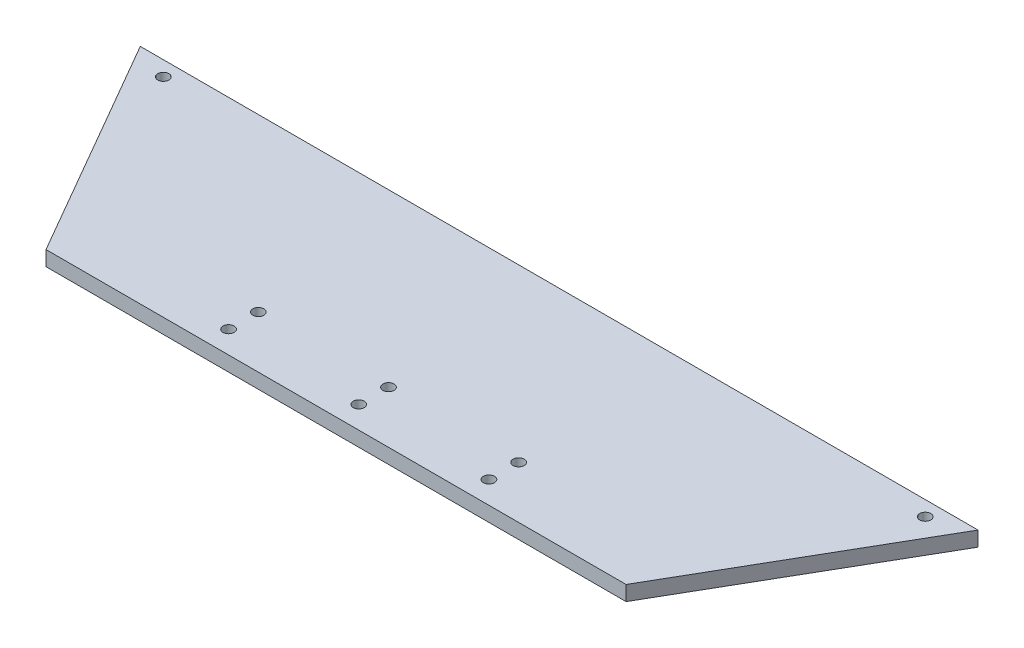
ISO-10303-21;
HEADER;
FILE_DESCRIPTION(('STEP AP214'),'2;1');
FILE_NAME('part.step','',(''),(''),'','','');
FILE_SCHEMA(('AUTOMOTIVE_DESIGN { 1 0 10303 214 1 1 1 1 }'));
ENDSEC;
DATA;
#1=APPLICATION_CONTEXT('core data for automotive mechanical design processes');
#2=APPLICATION_PROTOCOL_DEFINITION('international standard','automotive_design',2000,#1);
#3=PRODUCT_CONTEXT('',#1,'mechanical');
#4=PRODUCT('Part','Part','',(#3));
#5=PRODUCT_RELATED_PRODUCT_CATEGORY('part','',(#4));
#6=PRODUCT_DEFINITION_FORMATION('','',#4);
#7=PRODUCT_DEFINITION_CONTEXT('part definition',#1,'design');
#8=PRODUCT_DEFINITION('design','',#6,#7);
#9=PRODUCT_DEFINITION_SHAPE('','',#8);
#10=(LENGTH_UNIT() NAMED_UNIT(*) SI_UNIT(.MILLI.,.METRE.));
#11=(NAMED_UNIT(*) PLANE_ANGLE_UNIT() SI_UNIT($,.RADIAN.));
#12=(NAMED_UNIT(*) SI_UNIT($,.STERADIAN.) SOLID_ANGLE_UNIT());
#13=UNCERTAINTY_MEASURE_WITH_UNIT(LENGTH_MEASURE(1.E-05),#10,'distance_accuracy_value','');
#14=(GEOMETRIC_REPRESENTATION_CONTEXT(3) GLOBAL_UNCERTAINTY_ASSIGNED_CONTEXT((#13)) GLOBAL_UNIT_ASSIGNED_CONTEXT((#10,
#11,#12)) REPRESENTATION_CONTEXT('',''));
#15=CARTESIAN_POINT('',(0.,0.,0.));
#16=DIRECTION('',(0.,0.,1.));
#17=DIRECTION('',(1.,0.,0.));
#18=AXIS2_PLACEMENT_3D('',#15,#16,#17);
#19=CARTESIAN_POINT('',(-112.641016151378,4.,-60.));
#20=DIRECTION('',(0.866025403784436,0.,-0.500000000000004));
#21=DIRECTION('',(-0.500000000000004,0.,-0.866025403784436));
#22=AXIS2_PLACEMENT_3D('',#19,#20,#21);
#23=PLANE('',#22);
#24=DIRECTION('',(0.500000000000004,0.,0.866025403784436));
#25=VECTOR('',#24,1.);
#26=CARTESIAN_POINT('',(-112.641016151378,0.,-60.));
#27=LINE('',#26,#25);
#28=CARTESIAN_POINT('',(-112.641016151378,0.,-60.));
#29=VERTEX_POINT('',#28);
#30=CARTESIAN_POINT('',(-78.,0.,0.));
#31=VERTEX_POINT('',#30);
#32=EDGE_CURVE('E101',#29,#31,#27,.T.);
#33=ORIENTED_EDGE('',*,*,#32,.T.);
#34=DIRECTION('',(0.,-1.,0.));
#35=VECTOR('',#34,1.);
#36=CARTESIAN_POINT('',(-78.,4.,0.));
#37=LINE('',#36,#35);
#38=CARTESIAN_POINT('',(-78.,4.,0.));
#39=VERTEX_POINT('',#38);
#40=EDGE_CURVE('E11',#39,#31,#37,.T.);
#41=ORIENTED_EDGE('',*,*,#40,.F.);
#42=DIRECTION('',(0.500000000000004,0.,0.866025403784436));
#43=VECTOR('',#42,1.);
#44=CARTESIAN_POINT('',(-112.641016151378,4.,-60.));
#45=LINE('',#44,#43);
#46=CARTESIAN_POINT('',(-112.641016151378,4.,-60.));
#47=VERTEX_POINT('',#46);
#48=EDGE_CURVE('E88',#47,#39,#45,.T.);
#49=ORIENTED_EDGE('',*,*,#48,.F.);
#50=DIRECTION('',(0.,-1.,0.));
#51=VECTOR('',#50,1.);
#52=CARTESIAN_POINT('',(-112.641016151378,4.,-60.));
#53=LINE('',#52,#51);
#54=EDGE_CURVE('E97',#47,#29,#53,.T.);
#55=ORIENTED_EDGE('',*,*,#54,.T.);
#56=EDGE_LOOP('',(#33,#41,#49,#55));
#57=FACE_BOUND('',#56,.T.);
#58=ADVANCED_FACE('F35',(#57),#23,.F.);
#59=CARTESIAN_POINT('',(-78.,4.,0.));
#60=DIRECTION('',(0.,0.,-1.));
#61=DIRECTION('',(-1.,0.,0.));
#62=AXIS2_PLACEMENT_3D('',#59,#60,#61);
#63=PLANE('',#62);
#64=DIRECTION('',(1.,0.,0.));
#65=VECTOR('',#64,1.);
#66=CARTESIAN_POINT('',(-78.,0.,0.));
#67=LINE('',#66,#65);
#68=CARTESIAN_POINT('',(78.,0.,0.));
#69=VERTEX_POINT('',#68);
#70=EDGE_CURVE('E92',#31,#69,#67,.T.);
#71=ORIENTED_EDGE('',*,*,#70,.T.);
#72=DIRECTION('',(0.,-1.,0.));
#73=VECTOR('',#72,1.);
#74=CARTESIAN_POINT('',(78.,4.,0.));
#75=LINE('',#74,#73);
#76=CARTESIAN_POINT('',(78.,4.,0.));
#77=VERTEX_POINT('',#76);
#78=EDGE_CURVE('E44',#77,#69,#75,.T.);
#79=ORIENTED_EDGE('',*,*,#78,.F.);
#80=DIRECTION('',(1.,0.,0.));
#81=VECTOR('',#80,1.);
#82=CARTESIAN_POINT('',(-78.,4.,0.));
#83=LINE('',#82,#81);
#84=EDGE_CURVE('E83',#39,#77,#83,.T.);
#85=ORIENTED_EDGE('',*,*,#84,.F.);
#86=ORIENTED_EDGE('',*,*,#40,.T.);
#87=EDGE_LOOP('',(#71,#79,#85,#86));
#88=FACE_BOUND('',#87,.T.);
#89=ADVANCED_FACE('F91',(#88),#63,.F.);
#90=CARTESIAN_POINT('',(78.,4.,0.));
#91=DIRECTION('',(-0.866025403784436,0.,-0.500000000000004));
#92=DIRECTION('',(-0.500000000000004,0.,0.866025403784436));
#93=AXIS2_PLACEMENT_3D('',#90,#91,#92);
#94=PLANE('',#93);
#95=DIRECTION('',(0.500000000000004,0.,-0.866025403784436));
#96=VECTOR('',#95,1.);
#97=CARTESIAN_POINT('',(78.,0.,0.));
#98=LINE('',#97,#96);
#99=CARTESIAN_POINT('',(112.641016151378,0.,-60.));
#100=VERTEX_POINT('',#99);
#101=EDGE_CURVE('E70',#69,#100,#98,.T.);
#102=ORIENTED_EDGE('',*,*,#101,.T.);
#103=DIRECTION('',(0.,-1.,0.));
#104=VECTOR('',#103,1.);
#105=CARTESIAN_POINT('',(112.641016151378,4.,-60.));
#106=LINE('',#105,#104);
#107=CARTESIAN_POINT('',(112.641016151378,4.,-60.));
#108=VERTEX_POINT('',#107);
#109=EDGE_CURVE('E93',#108,#100,#106,.T.);
#110=ORIENTED_EDGE('',*,*,#109,.F.);
#111=DIRECTION('',(0.500000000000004,0.,-0.866025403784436));
#112=VECTOR('',#111,1.);
#113=CARTESIAN_POINT('',(78.,4.,0.));
#114=LINE('',#113,#112);
#115=EDGE_CURVE('E86',#77,#108,#114,.T.);
#116=ORIENTED_EDGE('',*,*,#115,.F.);
#117=ORIENTED_EDGE('',*,*,#78,.T.);
#118=EDGE_LOOP('',(#102,#110,#116,#117));
#119=FACE_BOUND('',#118,.T.);
#120=ADVANCED_FACE('F95',(#119),#94,.F.);
#121=CARTESIAN_POINT('',(112.641016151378,4.,-60.));
#122=DIRECTION('',(0.,0.,1.));
#123=DIRECTION('',(1.,0.,0.));
#124=AXIS2_PLACEMENT_3D('',#121,#122,#123);
#125=PLANE('',#124);
#126=DIRECTION('',(-1.,0.,0.));
#127=VECTOR('',#126,1.);
#128=CARTESIAN_POINT('',(112.641016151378,0.,-60.));
#129=LINE('',#128,#127);
#130=EDGE_CURVE('E76',#100,#29,#129,.T.);
#131=ORIENTED_EDGE('',*,*,#130,.T.);
#132=ORIENTED_EDGE('',*,*,#54,.F.);
#133=DIRECTION('',(-1.,0.,0.));
#134=VECTOR('',#133,1.);
#135=CARTESIAN_POINT('',(112.641016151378,4.,-60.));
#136=LINE('',#135,#134);
#137=EDGE_CURVE('E53',#108,#47,#136,.T.);
#138=ORIENTED_EDGE('',*,*,#137,.F.);
#139=ORIENTED_EDGE('',*,*,#109,.T.);
#140=EDGE_LOOP('',(#131,#132,#138,#139));
#141=FACE_BOUND('',#140,.T.);
#142=ADVANCED_FACE('F155',(#141),#125,.F.);
#143=CARTESIAN_POINT('',(0.,4.,0.));
#144=DIRECTION('',(0.,1.,0.));
#145=DIRECTION('',(0.,0.,1.));
#146=AXIS2_PLACEMENT_3D('',#143,#144,#145);
#147=PLANE('',#146);
#148=CARTESIAN_POINT('',(0.106818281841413,4.,-14.));
#149=DIRECTION('',(0.,-1.,0.));
#150=DIRECTION('',(0.,0.,-1.));
#151=AXIS2_PLACEMENT_3D('',#148,#149,#150);
#152=CIRCLE('',#151,1.5);
#153=CARTESIAN_POINT('',(0.106818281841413,4.,-15.5));
#154=VERTEX_POINT('',#153);
#155=EDGE_CURVE('E125',#154,#154,#152,.T.);
#156=ORIENTED_EDGE('',*,*,#155,.T.);
#157=EDGE_LOOP('',(#156));
#158=FACE_BOUND('',#157,.T.);
#159=CARTESIAN_POINT('',(-34.8931817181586,4.,-14.));
#160=DIRECTION('',(0.,-1.,0.));
#161=DIRECTION('',(0.,0.,-1.));
#162=AXIS2_PLACEMENT_3D('',#159,#160,#161);
#163=CIRCLE('',#162,1.5);
#164=CARTESIAN_POINT('',(-34.8931817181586,4.,-15.5));
#165=VERTEX_POINT('',#164);
#166=EDGE_CURVE('E277',#165,#165,#163,.T.);
#167=ORIENTED_EDGE('',*,*,#166,.T.);
#168=EDGE_LOOP('',(#167));
#169=FACE_BOUND('',#168,.T.);
#170=CARTESIAN_POINT('',(35.1068182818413,4.,-6.));
#171=DIRECTION('',(0.,-1.,0.));
#172=DIRECTION('',(0.,0.,-1.));
#173=AXIS2_PLACEMENT_3D('',#170,#171,#172);
#174=CIRCLE('',#173,1.5);
#175=CARTESIAN_POINT('',(35.1068182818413,4.,-7.5));
#176=VERTEX_POINT('',#175);
#177=EDGE_CURVE('E280',#176,#176,#174,.T.);
#178=ORIENTED_EDGE('',*,*,#177,.T.);
#179=EDGE_LOOP('',(#178));
#180=FACE_BOUND('',#179,.T.);
#181=CARTESIAN_POINT('',(0.106818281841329,4.,-6.));
#182=DIRECTION('',(0.,-1.,0.));
#183=DIRECTION('',(0.,0.,-1.));
#184=AXIS2_PLACEMENT_3D('',#181,#182,#183);
#185=CIRCLE('',#184,1.5);
#186=CARTESIAN_POINT('',(0.106818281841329,4.,-7.5));
#187=VERTEX_POINT('',#186);
#188=EDGE_CURVE('E284',#187,#187,#185,.T.);
#189=ORIENTED_EDGE('',*,*,#188,.T.);
#190=EDGE_LOOP('',(#189));
#191=FACE_BOUND('',#190,.T.);
#192=CARTESIAN_POINT('',(-34.8931817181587,4.,-6.00000000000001));
#193=DIRECTION('',(0.,-1.,0.));
#194=DIRECTION('',(0.,0.,-1.));
#195=AXIS2_PLACEMENT_3D('',#192,#193,#194);
#196=CIRCLE('',#195,1.5);
#197=CARTESIAN_POINT('',(-34.8931817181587,4.,-7.50000000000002));
#198=VERTEX_POINT('',#197);
#199=EDGE_CURVE('E143',#198,#198,#196,.T.);
#200=ORIENTED_EDGE('',*,*,#199,.T.);
#201=EDGE_LOOP('',(#200));
#202=FACE_BOUND('',#201,.T.);
#203=CARTESIAN_POINT('',(35.1068182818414,4.,-14.));
#204=DIRECTION('',(0.,-1.,0.));
#205=DIRECTION('',(0.,0.,-1.));
#206=AXIS2_PLACEMENT_3D('',#203,#204,#205);
#207=CIRCLE('',#206,1.5);
#208=CARTESIAN_POINT('',(35.1068182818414,4.,-15.5));
#209=VERTEX_POINT('',#208);
#210=EDGE_CURVE('E120',#209,#209,#207,.T.);
#211=ORIENTED_EDGE('',*,*,#210,.T.);
#212=EDGE_LOOP('',(#211));
#213=FACE_BOUND('',#212,.T.);
#214=CARTESIAN_POINT('',(-102.455970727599,4.,-56.0000000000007));
#215=DIRECTION('',(0.,1.,0.));
#216=DIRECTION('',(0.,0.,1.));
#217=AXIS2_PLACEMENT_3D('',#214,#215,#216);
#218=CIRCLE('',#217,1.5);
#219=CARTESIAN_POINT('',(-102.455970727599,4.,-54.5000000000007));
#220=VERTEX_POINT('',#219);
#221=EDGE_CURVE('E113',#220,#220,#218,.T.);
#222=ORIENTED_EDGE('',*,*,#221,.F.);
#223=EDGE_LOOP('',(#222));
#224=FACE_BOUND('',#223,.T.);
#225=CARTESIAN_POINT('',(102.4559707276,4.,-56.0000000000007));
#226=DIRECTION('',(0.,1.,0.));
#227=DIRECTION('',(0.,0.,1.));
#228=AXIS2_PLACEMENT_3D('',#225,#226,#227);
#229=CIRCLE('',#228,1.49999999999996);
#230=CARTESIAN_POINT('',(102.4559707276,4.,-54.5000000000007));
#231=VERTEX_POINT('',#230);
#232=EDGE_CURVE('E104',#231,#231,#229,.T.);
#233=ORIENTED_EDGE('',*,*,#232,.F.);
#234=EDGE_LOOP('',(#233));
#235=FACE_BOUND('',#234,.T.);
#236=ORIENTED_EDGE('',*,*,#48,.T.);
#237=ORIENTED_EDGE('',*,*,#84,.T.);
#238=ORIENTED_EDGE('',*,*,#115,.T.);
#239=ORIENTED_EDGE('',*,*,#137,.T.);
#240=EDGE_LOOP('',(#236,#237,#238,#239));
#241=FACE_BOUND('',#240,.T.);
#242=ADVANCED_FACE('F84',(#158,#169,#180,#191,#202,#213,#224,#235,#241),#147,.T.);
#243=CARTESIAN_POINT('',(0.,0.,0.));
#244=DIRECTION('',(0.,1.,0.));
#245=DIRECTION('',(0.,0.,1.));
#246=AXIS2_PLACEMENT_3D('',#243,#244,#245);
#247=PLANE('',#246);
#248=CARTESIAN_POINT('',(0.106818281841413,0.,-14.));
#249=DIRECTION('',(0.,1.,0.));
#250=DIRECTION('',(0.,0.,1.));
#251=AXIS2_PLACEMENT_3D('',#248,#249,#250);
#252=CIRCLE('',#251,1.5);
#253=CARTESIAN_POINT('',(0.106818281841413,0.,-12.5));
#254=VERTEX_POINT('',#253);
#255=EDGE_CURVE('E38',#254,#254,#252,.T.);
#256=ORIENTED_EDGE('',*,*,#255,.T.);
#257=EDGE_LOOP('',(#256));
#258=FACE_BOUND('',#257,.T.);
#259=CARTESIAN_POINT('',(-34.8931817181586,0.,-14.));
#260=DIRECTION('',(0.,1.,0.));
#261=DIRECTION('',(0.,0.,1.));
#262=AXIS2_PLACEMENT_3D('',#259,#260,#261);
#263=CIRCLE('',#262,1.5);
#264=CARTESIAN_POINT('',(-34.8931817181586,0.,-12.5));
#265=VERTEX_POINT('',#264);
#266=EDGE_CURVE('E130',#265,#265,#263,.T.);
#267=ORIENTED_EDGE('',*,*,#266,.T.);
#268=EDGE_LOOP('',(#267));
#269=FACE_BOUND('',#268,.T.);
#270=CARTESIAN_POINT('',(35.1068182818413,0.,-6.));
#271=DIRECTION('',(0.,1.,0.));
#272=DIRECTION('',(0.,0.,1.));
#273=AXIS2_PLACEMENT_3D('',#270,#271,#272);
#274=CIRCLE('',#273,1.5);
#275=CARTESIAN_POINT('',(35.1068182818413,0.,-4.49999999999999));
#276=VERTEX_POINT('',#275);
#277=EDGE_CURVE('E128',#276,#276,#274,.T.);
#278=ORIENTED_EDGE('',*,*,#277,.T.);
#279=EDGE_LOOP('',(#278));
#280=FACE_BOUND('',#279,.T.);
#281=CARTESIAN_POINT('',(0.106818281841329,0.,-6.));
#282=DIRECTION('',(0.,1.,0.));
#283=DIRECTION('',(0.,0.,1.));
#284=AXIS2_PLACEMENT_3D('',#281,#282,#283);
#285=CIRCLE('',#284,1.5);
#286=CARTESIAN_POINT('',(0.106818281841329,0.,-4.5));
#287=VERTEX_POINT('',#286);
#288=EDGE_CURVE('E124',#287,#287,#285,.T.);
#289=ORIENTED_EDGE('',*,*,#288,.T.);
#290=EDGE_LOOP('',(#289));
#291=FACE_BOUND('',#290,.T.);
#292=CARTESIAN_POINT('',(-34.8931817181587,0.,-6.00000000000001));
#293=DIRECTION('',(0.,1.,0.));
#294=DIRECTION('',(0.,0.,1.));
#295=AXIS2_PLACEMENT_3D('',#292,#293,#294);
#296=CIRCLE('',#295,1.5);
#297=CARTESIAN_POINT('',(-34.8931817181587,0.,-4.50000000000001));
#298=VERTEX_POINT('',#297);
#299=EDGE_CURVE('E121',#298,#298,#296,.T.);
#300=ORIENTED_EDGE('',*,*,#299,.T.);
#301=EDGE_LOOP('',(#300));
#302=FACE_BOUND('',#301,.T.);
#303=CARTESIAN_POINT('',(35.1068182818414,0.,-14.));
#304=DIRECTION('',(0.,1.,0.));
#305=DIRECTION('',(0.,0.,1.));
#306=AXIS2_PLACEMENT_3D('',#303,#304,#305);
#307=CIRCLE('',#306,1.5);
#308=CARTESIAN_POINT('',(35.1068182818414,0.,-12.5));
#309=VERTEX_POINT('',#308);
#310=EDGE_CURVE('E117',#309,#309,#307,.T.);
#311=ORIENTED_EDGE('',*,*,#310,.T.);
#312=EDGE_LOOP('',(#311));
#313=FACE_BOUND('',#312,.T.);
#314=CARTESIAN_POINT('',(-102.455970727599,0.,-56.0000000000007));
#315=DIRECTION('',(0.,1.,0.));
#316=DIRECTION('',(0.,0.,1.));
#317=AXIS2_PLACEMENT_3D('',#314,#315,#316);
#318=CIRCLE('',#317,1.5);
#319=CARTESIAN_POINT('',(-102.455970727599,0.,-54.5000000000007));
#320=VERTEX_POINT('',#319);
#321=EDGE_CURVE('E114',#320,#320,#318,.T.);
#322=ORIENTED_EDGE('',*,*,#321,.T.);
#323=EDGE_LOOP('',(#322));
#324=FACE_BOUND('',#323,.T.);
#325=CARTESIAN_POINT('',(102.4559707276,0.,-56.0000000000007));
#326=DIRECTION('',(0.,1.,0.));
#327=DIRECTION('',(0.,0.,1.));
#328=AXIS2_PLACEMENT_3D('',#325,#326,#327);
#329=CIRCLE('',#328,1.49999999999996);
#330=CARTESIAN_POINT('',(102.4559707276,0.,-54.5000000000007));
#331=VERTEX_POINT('',#330);
#332=EDGE_CURVE('E110',#331,#331,#329,.T.);
#333=ORIENTED_EDGE('',*,*,#332,.T.);
#334=EDGE_LOOP('',(#333));
#335=FACE_BOUND('',#334,.T.);
#336=ORIENTED_EDGE('',*,*,#32,.F.);
#337=ORIENTED_EDGE('',*,*,#130,.F.);
#338=ORIENTED_EDGE('',*,*,#101,.F.);
#339=ORIENTED_EDGE('',*,*,#70,.F.);
#340=EDGE_LOOP('',(#336,#337,#338,#339));
#341=FACE_BOUND('',#340,.T.);
#342=ADVANCED_FACE('F154',(#258,#269,#280,#291,#302,#313,#324,#335,#341),#247,.F.);
#343=CARTESIAN_POINT('',(102.4559707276,17.,-56.0000000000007));
#344=DIRECTION('',(0.,-1.,0.));
#345=DIRECTION('',(0.,0.,-1.));
#346=AXIS2_PLACEMENT_3D('',#343,#344,#345);
#347=CYLINDRICAL_SURFACE('',#346,1.49999999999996);
#348=ORIENTED_EDGE('',*,*,#232,.T.);
#349=EDGE_LOOP('',(#348));
#350=FACE_BOUND('',#349,.T.);
#351=ORIENTED_EDGE('',*,*,#332,.F.);
#352=EDGE_LOOP('',(#351));
#353=FACE_BOUND('',#352,.T.);
#354=ADVANCED_FACE('F150',(#350,#353),#347,.F.);
#355=CARTESIAN_POINT('',(-102.455970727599,17.,-56.0000000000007));
#356=DIRECTION('',(0.,-1.,0.));
#357=DIRECTION('',(0.,0.,-1.));
#358=AXIS2_PLACEMENT_3D('',#355,#356,#357);
#359=CYLINDRICAL_SURFACE('',#358,1.5);
#360=ORIENTED_EDGE('',*,*,#221,.T.);
#361=EDGE_LOOP('',(#360));
#362=FACE_BOUND('',#361,.T.);
#363=ORIENTED_EDGE('',*,*,#321,.F.);
#364=EDGE_LOOP('',(#363));
#365=FACE_BOUND('',#364,.T.);
#366=ADVANCED_FACE('F194',(#362,#365),#359,.F.);
#367=CARTESIAN_POINT('',(35.1068182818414,4.,-14.));
#368=DIRECTION('',(0.,-1.,0.));
#369=DIRECTION('',(0.,0.,-1.));
#370=AXIS2_PLACEMENT_3D('',#367,#368,#369);
#371=CYLINDRICAL_SURFACE('',#370,1.5);
#372=ORIENTED_EDGE('',*,*,#210,.F.);
#373=EDGE_LOOP('',(#372));
#374=FACE_BOUND('',#373,.T.);
#375=ORIENTED_EDGE('',*,*,#310,.F.);
#376=EDGE_LOOP('',(#375));
#377=FACE_BOUND('',#376,.T.);
#378=ADVANCED_FACE('F202',(#374,#377),#371,.F.);
#379=CARTESIAN_POINT('',(-34.8931817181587,4.,-6.00000000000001));
#380=DIRECTION('',(0.,-1.,0.));
#381=DIRECTION('',(0.,0.,-1.));
#382=AXIS2_PLACEMENT_3D('',#379,#380,#381);
#383=CYLINDRICAL_SURFACE('',#382,1.5);
#384=ORIENTED_EDGE('',*,*,#199,.F.);
#385=EDGE_LOOP('',(#384));
#386=FACE_BOUND('',#385,.T.);
#387=ORIENTED_EDGE('',*,*,#299,.F.);
#388=EDGE_LOOP('',(#387));
#389=FACE_BOUND('',#388,.T.);
#390=ADVANCED_FACE('F221',(#386,#389),#383,.F.);
#391=CARTESIAN_POINT('',(0.106818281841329,4.,-6.));
#392=DIRECTION('',(0.,-1.,0.));
#393=DIRECTION('',(0.,0.,-1.));
#394=AXIS2_PLACEMENT_3D('',#391,#392,#393);
#395=CYLINDRICAL_SURFACE('',#394,1.5);
#396=ORIENTED_EDGE('',*,*,#188,.F.);
#397=EDGE_LOOP('',(#396));
#398=FACE_BOUND('',#397,.T.);
#399=ORIENTED_EDGE('',*,*,#288,.F.);
#400=EDGE_LOOP('',(#399));
#401=FACE_BOUND('',#400,.T.);
#402=ADVANCED_FACE('F231',(#398,#401),#395,.F.);
#403=CARTESIAN_POINT('',(35.1068182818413,4.,-6.));
#404=DIRECTION('',(0.,-1.,0.));
#405=DIRECTION('',(0.,0.,-1.));
#406=AXIS2_PLACEMENT_3D('',#403,#404,#405);
#407=CYLINDRICAL_SURFACE('',#406,1.5);
#408=ORIENTED_EDGE('',*,*,#177,.F.);
#409=EDGE_LOOP('',(#408));
#410=FACE_BOUND('',#409,.T.);
#411=ORIENTED_EDGE('',*,*,#277,.F.);
#412=EDGE_LOOP('',(#411));
#413=FACE_BOUND('',#412,.T.);
#414=ADVANCED_FACE('F241',(#410,#413),#407,.F.);
#415=CARTESIAN_POINT('',(-34.8931817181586,4.,-14.));
#416=DIRECTION('',(0.,-1.,0.));
#417=DIRECTION('',(0.,0.,-1.));
#418=AXIS2_PLACEMENT_3D('',#415,#416,#417);
#419=CYLINDRICAL_SURFACE('',#418,1.5);
#420=ORIENTED_EDGE('',*,*,#166,.F.);
#421=EDGE_LOOP('',(#420));
#422=FACE_BOUND('',#421,.T.);
#423=ORIENTED_EDGE('',*,*,#266,.F.);
#424=EDGE_LOOP('',(#423));
#425=FACE_BOUND('',#424,.T.);
#426=ADVANCED_FACE('F251',(#422,#425),#419,.F.);
#427=CARTESIAN_POINT('',(0.106818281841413,4.,-14.));
#428=DIRECTION('',(0.,-1.,0.));
#429=DIRECTION('',(0.,0.,-1.));
#430=AXIS2_PLACEMENT_3D('',#427,#428,#429);
#431=CYLINDRICAL_SURFACE('',#430,1.5);
#432=ORIENTED_EDGE('',*,*,#155,.F.);
#433=EDGE_LOOP('',(#432));
#434=FACE_BOUND('',#433,.T.);
#435=ORIENTED_EDGE('',*,*,#255,.F.);
#436=EDGE_LOOP('',(#435));
#437=FACE_BOUND('',#436,.T.);
#438=ADVANCED_FACE('F261',(#434,#437),#431,.F.);
#439=CLOSED_SHELL('',(#58,#89,#120,#142,#242,#342,#354,#366,#378,#390,#402,#414,#426,#438));
#440=MANIFOLD_SOLID_BREP('B2',#439);
#441=ADVANCED_BREP_SHAPE_REPRESENTATION('',(#18,#440),#14);
#442=SHAPE_DEFINITION_REPRESENTATION(#9,#441);
ENDSEC;
END-ISO-10303-21;
